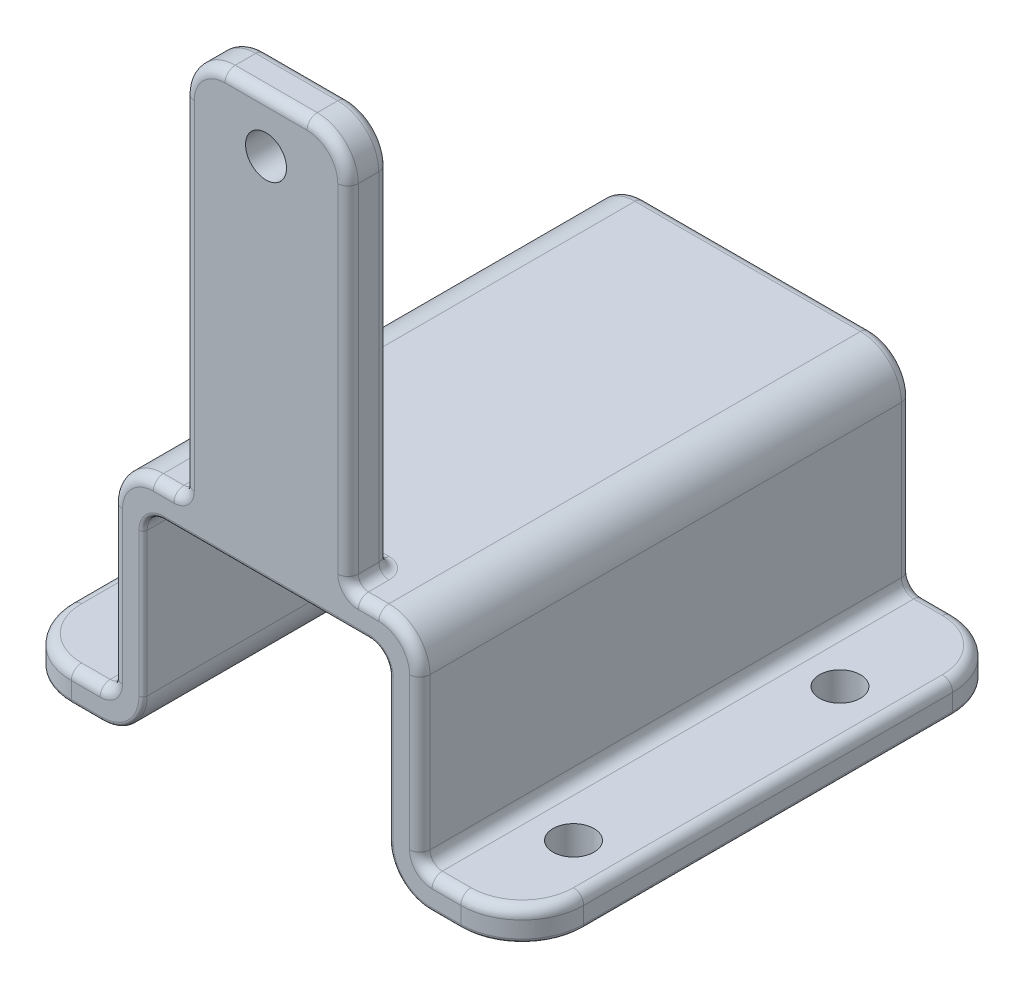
from build123d import *

# Parameters (mm, degrees)
EXTRUDE_1_DEPTH     = 24
FILLET_1_R          = 2
FILLET_2_R          = 2
FILLET_3_R          = 3
FILLET_4_R          = 1
FILLET_5_R          = 0.6
SKETCH_2_R          = 1
CUT_EXTRUDE_1_DEPTH = 10
SKETCH_3_W          = 8
SKETCH_3_H          = 2
EXTRUDE_2_DEPTH     = 19
SKETCH_4_R          = 1
CUT_EXTRUDE_2_DEPTH = 6
FILLET_6_R          = 2
FILLET_7_R          = 0.5
FILLET_8_R          = 0.2


with BuildPart() as part:
    # Sketch 1 → Extrude 1 (new body)
    with BuildSketch(Plane.XY):
        Polygon((-12.5, 0), (-6, 0), (-6, 10), (6, 10), (6, 0), (12.5, 0), (12.5, 1.5), (7.5, 1.5), (7.5, 11.5), (-7.5, 11.5), (-7.5, 1.5), (-12.5, 1.5), align=None)
    extrude(amount=EXTRUDE_1_DEPTH)

    # Fillet 1
    fillet_1_edges = [part.edges().sort_by_distance(p)[0] for p in [
        (6, 0, 12),
        (-6, 0, 12),
    ]]
    fillet(fillet_1_edges, radius=FILLET_1_R)

    # Fillet 2
    fillet_2_edges = [part.edges().sort_by_distance(p)[0] for p in [
        (7.5, 11.5, 12),
        (-7.5, 11.5, 12),
    ]]
    fillet(fillet_2_edges, radius=FILLET_2_R)

    # Fillet 3
    fillet_3_edges = [part.edges().sort_by_distance(p)[0] for p in [
        (12.5, 0.75, 0),
        (-12.5, 0.75, 24),
        (-12.5, 0.75, 0),
        (12.5, 0.75, 24),
    ]]
    fillet(fillet_3_edges, radius=FILLET_3_R)

    # Fillet 4
    fillet_4_edges = [part.edges().sort_by_distance(p)[0] for p in [
        (6, 10, 12),
        (-6, 10, 12),
    ]]
    fillet(fillet_4_edges, radius=FILLET_4_R)

    # Fillet 5
    fillet_5_edges = [part.edges().sort_by_distance(p)[0] for p in [
        (7.5, 1.5, 12),
        (-7.5, 1.5, 12),
    ]]
    fillet(fillet_5_edges, radius=FILLET_5_R)

    # Sketch 2 → Cut-Extrude 1 (cut)
    with BuildSketch(Plane(origin=(0, 1.5, 0), x_dir=(1, 0, 0), z_dir=(0, 1, 0))):
        with Locations(Location((-10, -6, 0), (0, 0, 270))):
            Circle(SKETCH_2_R)
        with Locations(Location((10, -19, 0), (0, 0, 270))):
            Circle(SKETCH_2_R)
        with Locations(Location((-10, -19, 0), (0, 0, 270))):
            Circle(SKETCH_2_R)
        with Locations(Location((10, -6, 0), (0, 0, 270))):
            Circle(SKETCH_2_R)
    extrude(amount=-CUT_EXTRUDE_1_DEPTH, mode=Mode.SUBTRACT)

    # Sketch 3 → Extrude 2 (add)
    with BuildSketch(Plane(origin=(0, 11.5, 0), x_dir=(1, 0, 0), z_dir=(0, 1, 0))):
        with Locations((0, -23)):
            Rectangle(SKETCH_3_W, SKETCH_3_H)
    extrude(amount=EXTRUDE_2_DEPTH)

    # Sketch 4 → Cut-Extrude 2 (cut)
    with BuildSketch(Plane.XY.offset(24)):
        with Locations((0, 27.9)):
            Circle(SKETCH_4_R)
    extrude(amount=-CUT_EXTRUDE_2_DEPTH, mode=Mode.SUBTRACT)

    # Fillet 6
    fillet_6_edges = [part.edges().sort_by_distance(p)[0] for p in [
        (-4, 30.5, 23),
        (4, 30.5, 23),
    ]]
    fillet(fillet_6_edges, radius=FILLET_6_R)

    # Fillet 7
    fillet_7_edges = [part.edges().sort_by_distance(p)[0] for p in [
        (7.675735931, 1.675735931, 0),
        (7.675735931, 1.675735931, 24),
        (-7.675735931, 1.675735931, 0),
        (-7.675735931, 1.675735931, 24),
        (-4.75, 11.5, 24),
        (-4, 11.5, 23),
        (4, 11.5, 23),
        (0, 11.5, 22),
        (0, 30.5, 24),
        (0, 30.5, 22),
        (-4, 20, 22),
        (4, 20, 22),
        (-3.414213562, 29.914213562, 22),
        (3.414213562, 29.914213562, 22),
        (4, 20, 24),
        (-4, 20, 24),
        (-3.414213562, 29.914213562, 24),
        (3.414213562, 29.914213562, 24),
        (-7.5, 5.8, 0),
        (-7.5, 5.8, 24),
        (0, 11.5, 0),
        (6.914213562, 10.914213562, 0),
        (-6.914213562, 10.914213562, 0),
        (4.75, 11.5, 24),
        (6.914213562, 10.914213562, 24),
        (-6.914213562, 10.914213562, 24),
        (8.8, 1.5, 24),
        (-12.5, 1.5, 12),
        (-11.621320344, 1.5, 0.878679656),
        (-11.621320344, 1.5, 23.121320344),
        (8.8, 1.5, 0),
        (12.5, 1.5, 12),
        (11.621320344, 1.5, 0.878679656),
        (11.621320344, 1.5, 23.121320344),
        (7.5, 5.8, 0),
        (7.5, 5.8, 24),
        (-8.8, 1.5, 24),
        (-8.8, 1.5, 0),
    ]]
    fillet(fillet_7_edges, radius=FILLET_7_R)

    # Fillet 8
    fillet_8_edges = [part.edges().sort_by_distance(p)[0] for p in [
        (8.75, 0, 0),
        (8.75, 0, 24),
        (-6, 5.5, 0),
        (-6.585786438, 0.585786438, 0),
        (6.585786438, 0.585786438, 0),
        (-6, 5.5, 24),
        (-6.585786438, 0.585786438, 24),
        (6.585786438, 0.585786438, 24),
        (-8.75, 0, 24),
        (-8.75, 0, 0),
        (-12.5, 0, 12),
        (-11.621320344, 0, 0.878679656),
        (-11.621320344, 0, 23.121320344),
        (12.5, 0, 12),
        (11.621320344, 0, 0.878679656),
        (11.621320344, 0, 23.121320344),
        (0, 10, 0),
        (0, 10, 24),
        (6, 5.5, 0),
        (6, 5.5, 24),
        (-5.707106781, 9.707106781, 0),
        (-5.707106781, 9.707106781, 24),
        (5.707106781, 9.707106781, 0),
        (5.707106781, 9.707106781, 24),
    ]]
    fillet(fillet_8_edges, radius=FILLET_8_R)


solid = part.part
